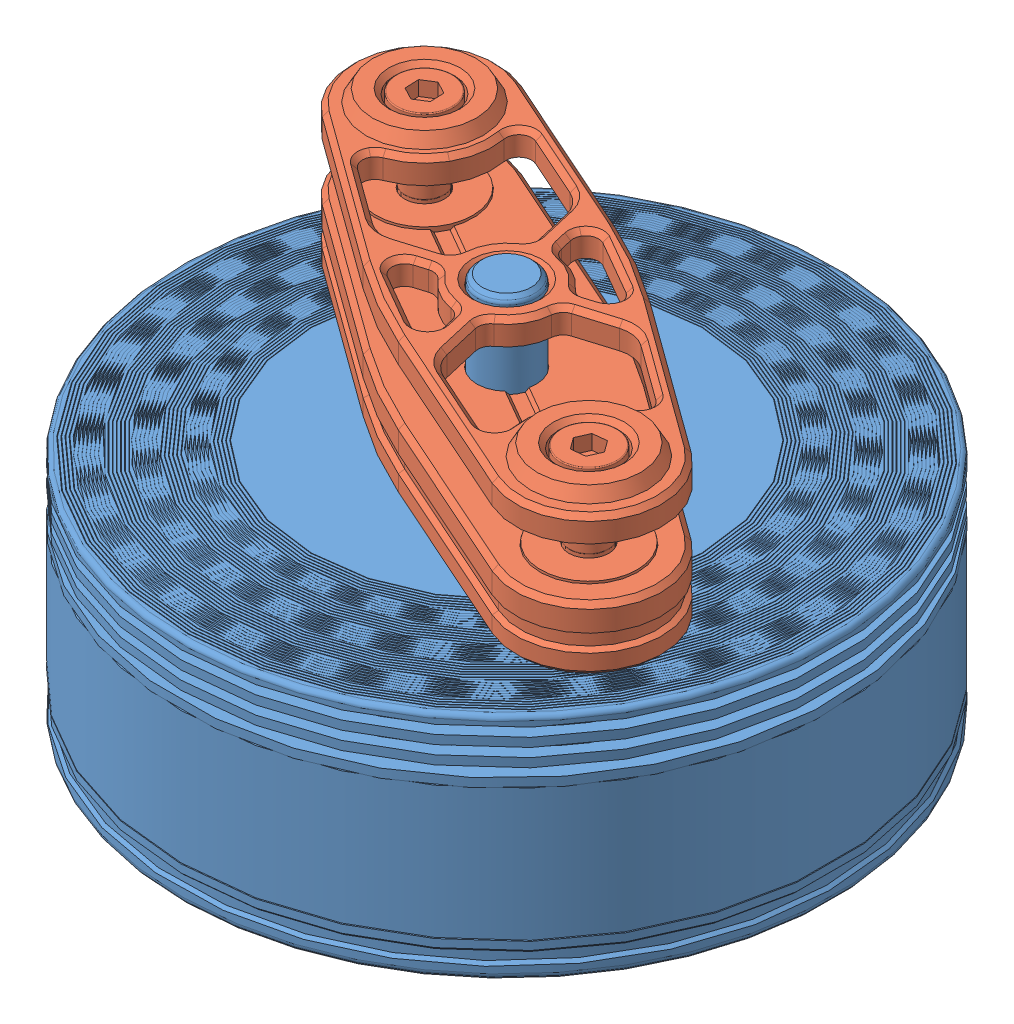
SolidWorks assembly M600 ARM_6-002.sldasm, configuration Default (file format 9000). Lengths in mm.
Overall size (66.7 44.1 67.01).
2 component instances, 2 part files, 0 mates.
Components (placement in the parent):
- M600 ARM_6-22-1: M600 ARM_6-22.sldprt [Default] at (0.641 -20.0205 91.2421) size (66.7 43.4 67.01)
- M600 ARM_6-21-1: M600 ARM_6-21.sldprt [Default] at (0.641 -20.0205 91.2421) x (0.999986 0 -0.005305) z (0.005305 0 0.999986) size (54.71 20.5 38.21)
